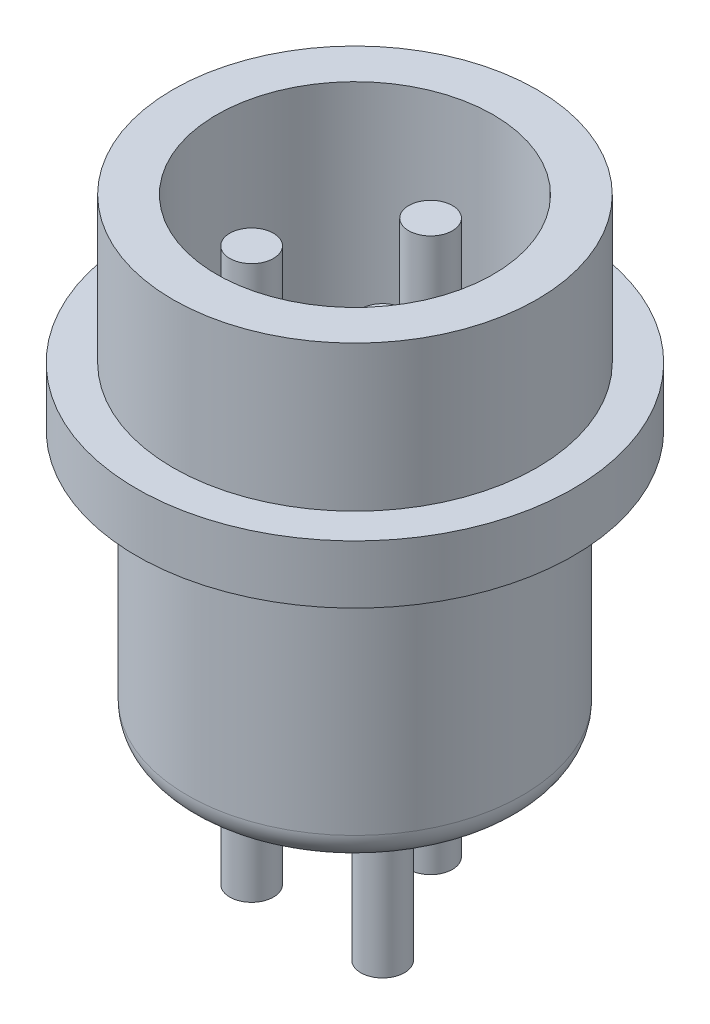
from build123d import *

# Parameters (mm, degrees)
BOSS_EXTRU_1_DEPTH      = 8
BOSS_EXTRU_1_DEPTH_BACK = 11
ESQUISSE2_R             = 0.75
CONG_1_R                = 1


with BuildPart() as part:
    # Esquisse1 → R_volution1 (revolve)
    with BuildSketch(Plane.XY, mode=Mode.PRIVATE) as r_volution1_sk:
        Polygon((0, 0), (4.75, 0), (4.75, 10), (6.25, 10), (6.25, 5), (7.5, 5), (7.5, 3), (5.75, 3), (5.75, -6), (0, -6), align=None)
    revolve(r_volution1_sk.sketch.rotate(Axis((0, 0, 0), (0, 1, 0)), 90), axis=Axis((0, 0, 0), (0, 1, 0)))

    # Esquisse2 → Boss.-Extru.1 (add, two sides: drawn at the far end of the back side and taken through both)
    with BuildSketch(Plane(origin=(0, 0, 0), x_dir=(1, 0, 0), z_dir=(0, 1, 0)).offset(-BOSS_EXTRU_1_DEPTH_BACK)):
        with Locations(Location((0, 2.598076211, 0), (0, 0, 270))):
            Circle(ESQUISSE2_R)
        with Locations(Location((-2.25, -1.299038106, 0), (0, 0, 270))):
            Circle(ESQUISSE2_R)
        with Locations(Location((2.25, -1.299038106, 0), (0, 0, 270))):
            Circle(ESQUISSE2_R)
    extrude(amount=BOSS_EXTRU_1_DEPTH + BOSS_EXTRU_1_DEPTH_BACK)

    # Cong_1
    cong_1_edges = [part.edges().sort_by_distance(p)[0] for p in [
        (0, -6, 5.75),
    ]]
    fillet(cong_1_edges, radius=CONG_1_R)


solid = part.part
